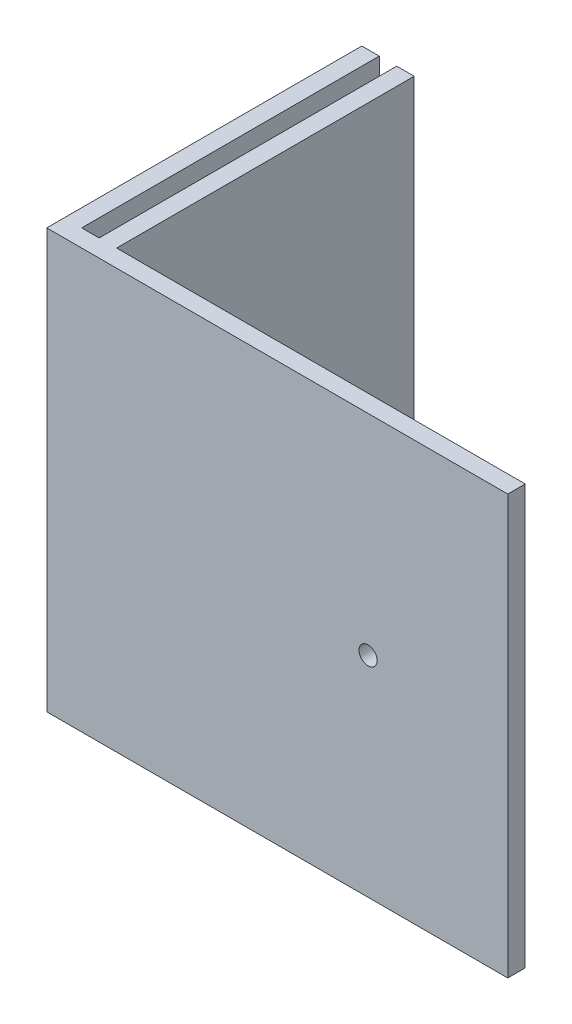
ISO-10303-21;
HEADER;
FILE_DESCRIPTION(('STEP AP214'),'2;1');
FILE_NAME('part.step','',(''),(''),'','','');
FILE_SCHEMA(('AUTOMOTIVE_DESIGN { 1 0 10303 214 1 1 1 1 }'));
ENDSEC;
DATA;
#1=APPLICATION_CONTEXT('core data for automotive mechanical design processes');
#2=APPLICATION_PROTOCOL_DEFINITION('international standard','automotive_design',2000,#1);
#3=PRODUCT_CONTEXT('',#1,'mechanical');
#4=PRODUCT('Part','Part','',(#3));
#5=PRODUCT_RELATED_PRODUCT_CATEGORY('part','',(#4));
#6=PRODUCT_DEFINITION_FORMATION('','',#4);
#7=PRODUCT_DEFINITION_CONTEXT('part definition',#1,'design');
#8=PRODUCT_DEFINITION('design','',#6,#7);
#9=PRODUCT_DEFINITION_SHAPE('','',#8);
#10=(LENGTH_UNIT() NAMED_UNIT(*) SI_UNIT(.MILLI.,.METRE.));
#11=(NAMED_UNIT(*) PLANE_ANGLE_UNIT() SI_UNIT($,.RADIAN.));
#12=(NAMED_UNIT(*) SI_UNIT($,.STERADIAN.) SOLID_ANGLE_UNIT());
#13=UNCERTAINTY_MEASURE_WITH_UNIT(LENGTH_MEASURE(1.E-05),#10,'distance_accuracy_value','');
#14=(GEOMETRIC_REPRESENTATION_CONTEXT(3) GLOBAL_UNCERTAINTY_ASSIGNED_CONTEXT((#13)) GLOBAL_UNIT_ASSIGNED_CONTEXT((#10,
#11,#12)) REPRESENTATION_CONTEXT('',''));
#15=CARTESIAN_POINT('',(0.,0.,0.));
#16=DIRECTION('',(0.,0.,1.));
#17=DIRECTION('',(1.,0.,0.));
#18=AXIS2_PLACEMENT_3D('',#15,#16,#17);
#19=CARTESIAN_POINT('',(0.,0.,0.));
#20=DIRECTION('',(0.,0.,1.));
#21=DIRECTION('',(1.,0.,0.));
#22=AXIS2_PLACEMENT_3D('',#19,#20,#21);
#23=PLANE('',#22);
#24=DIRECTION('',(-1.,0.,0.));
#25=VECTOR('',#24,1.);
#26=CARTESIAN_POINT('',(0.,76.2,0.));
#27=LINE('',#26,#25);
#28=CARTESIAN_POINT('',(-77.47,76.2,0.));
#29=VERTEX_POINT('',#28);
#30=CARTESIAN_POINT('',(-80.645,76.2,0.));
#31=VERTEX_POINT('',#30);
#32=EDGE_CURVE('E182',#29,#31,#27,.T.);
#33=ORIENTED_EDGE('',*,*,#32,.F.);
#34=DIRECTION('',(0.,-1.,0.));
#35=VECTOR('',#34,1.);
#36=CARTESIAN_POINT('',(-77.47,0.,0.));
#37=LINE('',#36,#35);
#38=CARTESIAN_POINT('',(-77.47,0.,0.));
#39=VERTEX_POINT('',#38);
#40=EDGE_CURVE('E142',#29,#39,#37,.T.);
#41=ORIENTED_EDGE('',*,*,#40,.T.);
#42=DIRECTION('',(1.,0.,0.));
#43=VECTOR('',#42,1.);
#44=CARTESIAN_POINT('',(-83.82,0.,0.));
#45=LINE('',#44,#43);
#46=CARTESIAN_POINT('',(-80.645,0.,0.));
#47=VERTEX_POINT('',#46);
#48=EDGE_CURVE('E112',#47,#39,#45,.T.);
#49=ORIENTED_EDGE('',*,*,#48,.F.);
#50=DIRECTION('',(0.,1.,0.));
#51=VECTOR('',#50,1.);
#52=CARTESIAN_POINT('',(-80.645,0.,0.));
#53=LINE('',#52,#51);
#54=EDGE_CURVE('E158',#47,#31,#53,.T.);
#55=ORIENTED_EDGE('',*,*,#54,.T.);
#56=EDGE_LOOP('',(#33,#41,#49,#55));
#57=FACE_BOUND('',#56,.T.);
#58=ADVANCED_FACE('F33',(#57),#23,.F.);
#59=CARTESIAN_POINT('',(0.,0.,3.175));
#60=DIRECTION('',(0.,0.,1.));
#61=DIRECTION('',(1.,0.,0.));
#62=AXIS2_PLACEMENT_3D('',#59,#60,#61);
#63=PLANE('',#62);
#64=DIRECTION('',(-1.,0.,0.));
#65=VECTOR('',#64,1.);
#66=CARTESIAN_POINT('',(0.,76.2,3.175));
#67=LINE('',#66,#65);
#68=CARTESIAN_POINT('',(0.,76.2,3.175));
#69=VERTEX_POINT('',#68);
#70=CARTESIAN_POINT('',(-83.82,76.2,3.175));
#71=VERTEX_POINT('',#70);
#72=EDGE_CURVE('E174',#69,#71,#67,.T.);
#73=ORIENTED_EDGE('',*,*,#72,.T.);
#74=DIRECTION('',(0.,-1.,0.));
#75=VECTOR('',#74,1.);
#76=CARTESIAN_POINT('',(-83.82,76.2,3.175));
#77=LINE('',#76,#75);
#78=CARTESIAN_POINT('',(-83.82,0.,3.175));
#79=VERTEX_POINT('',#78);
#80=EDGE_CURVE('E176',#71,#79,#77,.T.);
#81=ORIENTED_EDGE('',*,*,#80,.T.);
#82=DIRECTION('',(1.,0.,0.));
#83=VECTOR('',#82,1.);
#84=CARTESIAN_POINT('',(-83.82,0.,3.175));
#85=LINE('',#84,#83);
#86=CARTESIAN_POINT('',(0.,0.,3.175));
#87=VERTEX_POINT('',#86);
#88=EDGE_CURVE('E169',#79,#87,#85,.T.);
#89=ORIENTED_EDGE('',*,*,#88,.T.);
#90=DIRECTION('',(0.,1.,0.));
#91=VECTOR('',#90,1.);
#92=CARTESIAN_POINT('',(0.,0.,3.175));
#93=LINE('',#92,#91);
#94=EDGE_CURVE('E171',#87,#69,#93,.T.);
#95=ORIENTED_EDGE('',*,*,#94,.T.);
#96=EDGE_LOOP('',(#73,#81,#89,#95));
#97=FACE_BOUND('',#96,.T.);
#98=CARTESIAN_POINT('',(-25.4,38.1,3.175));
#99=DIRECTION('',(0.,0.,1.));
#100=DIRECTION('',(1.,0.,0.));
#101=AXIS2_PLACEMENT_3D('',#98,#99,#100);
#102=CIRCLE('',#101,1.651);
#103=CARTESIAN_POINT('',(-23.749,38.1,3.175));
#104=VERTEX_POINT('',#103);
#105=EDGE_CURVE('E163',#104,#104,#102,.T.);
#106=ORIENTED_EDGE('',*,*,#105,.F.);
#107=EDGE_LOOP('',(#106));
#108=FACE_BOUND('',#107,.T.);
#109=ADVANCED_FACE('F219',(#97,#108),#63,.T.);
#110=CARTESIAN_POINT('',(-74.295,0.,0.));
#111=VERTEX_POINT('',#110);
#112=CARTESIAN_POINT('',(0.,0.,0.));
#113=VERTEX_POINT('',#112);
#114=EDGE_CURVE('E166',#111,#113,#45,.T.);
#115=ORIENTED_EDGE('',*,*,#114,.F.);
#116=DIRECTION('',(0.,1.,0.));
#117=VECTOR('',#116,1.);
#118=CARTESIAN_POINT('',(-74.295,0.,0.));
#119=LINE('',#118,#117);
#120=CARTESIAN_POINT('',(-74.295,76.2,0.));
#121=VERTEX_POINT('',#120);
#122=EDGE_CURVE('E136',#111,#121,#119,.T.);
#123=ORIENTED_EDGE('',*,*,#122,.T.);
#124=CARTESIAN_POINT('',(0.,76.2,0.));
#125=VERTEX_POINT('',#124);
#126=EDGE_CURVE('E172',#125,#121,#27,.T.);
#127=ORIENTED_EDGE('',*,*,#126,.F.);
#128=DIRECTION('',(0.,1.,0.));
#129=VECTOR('',#128,1.);
#130=CARTESIAN_POINT('',(0.,0.,0.));
#131=LINE('',#130,#129);
#132=EDGE_CURVE('E180',#113,#125,#131,.T.);
#133=ORIENTED_EDGE('',*,*,#132,.F.);
#134=EDGE_LOOP('',(#115,#123,#127,#133));
#135=FACE_BOUND('',#134,.T.);
#136=CARTESIAN_POINT('',(-25.4,38.1,0.));
#137=DIRECTION('',(0.,0.,1.));
#138=DIRECTION('',(1.,0.,0.));
#139=AXIS2_PLACEMENT_3D('',#136,#137,#138);
#140=CIRCLE('',#139,1.651);
#141=CARTESIAN_POINT('',(-23.749,38.1,0.));
#142=VERTEX_POINT('',#141);
#143=EDGE_CURVE('E162',#142,#142,#140,.T.);
#144=ORIENTED_EDGE('',*,*,#143,.T.);
#145=EDGE_LOOP('',(#144));
#146=FACE_BOUND('',#145,.T.);
#147=ADVANCED_FACE('F199',(#135,#146),#23,.F.);
#148=CARTESIAN_POINT('',(-83.82,0.,3.175));
#149=DIRECTION('',(0.,1.,0.));
#150=DIRECTION('',(0.,0.,1.));
#151=AXIS2_PLACEMENT_3D('',#148,#149,#150);
#152=PLANE('',#151);
#153=DIRECTION('',(0.,0.,-1.));
#154=VECTOR('',#153,1.);
#155=CARTESIAN_POINT('',(0.,0.,3.175));
#156=LINE('',#155,#154);
#157=EDGE_CURVE('E11',#87,#113,#156,.T.);
#158=ORIENTED_EDGE('',*,*,#157,.F.);
#159=ORIENTED_EDGE('',*,*,#88,.F.);
#160=DIRECTION('',(0.,0.,-1.));
#161=VECTOR('',#160,1.);
#162=CARTESIAN_POINT('',(-83.82,0.,3.175));
#163=LINE('',#162,#161);
#164=CARTESIAN_POINT('',(-83.82,0.,-54.102));
#165=VERTEX_POINT('',#164);
#166=EDGE_CURVE('E178',#79,#165,#163,.T.);
#167=ORIENTED_EDGE('',*,*,#166,.T.);
#168=DIRECTION('',(1.,0.,0.));
#169=VECTOR('',#168,1.);
#170=CARTESIAN_POINT('',(-83.82,0.,-54.102));
#171=LINE('',#170,#169);
#172=CARTESIAN_POINT('',(-80.645,0.,-54.102));
#173=VERTEX_POINT('',#172);
#174=EDGE_CURVE('E147',#165,#173,#171,.T.);
#175=ORIENTED_EDGE('',*,*,#174,.T.);
#176=DIRECTION('',(0.,0.,1.));
#177=VECTOR('',#176,1.);
#178=CARTESIAN_POINT('',(-80.645,0.,-54.102));
#179=LINE('',#178,#177);
#180=EDGE_CURVE('E55',#173,#47,#179,.T.);
#181=ORIENTED_EDGE('',*,*,#180,.T.);
#182=ORIENTED_EDGE('',*,*,#48,.T.);
#183=DIRECTION('',(0.,0.,1.));
#184=VECTOR('',#183,1.);
#185=CARTESIAN_POINT('',(-77.47,0.,-54.102));
#186=LINE('',#185,#184);
#187=CARTESIAN_POINT('',(-77.47,0.,-54.102));
#188=VERTEX_POINT('',#187);
#189=EDGE_CURVE('E107',#188,#39,#186,.T.);
#190=ORIENTED_EDGE('',*,*,#189,.F.);
#191=DIRECTION('',(1.,0.,0.));
#192=VECTOR('',#191,1.);
#193=CARTESIAN_POINT('',(-77.47,0.,-54.102));
#194=LINE('',#193,#192);
#195=CARTESIAN_POINT('',(-74.295,0.,-54.102));
#196=VERTEX_POINT('',#195);
#197=EDGE_CURVE('E110',#188,#196,#194,.T.);
#198=ORIENTED_EDGE('',*,*,#197,.T.);
#199=DIRECTION('',(0.,0.,1.));
#200=VECTOR('',#199,1.);
#201=CARTESIAN_POINT('',(-74.295,0.,-54.102));
#202=LINE('',#201,#200);
#203=EDGE_CURVE('E48',#196,#111,#202,.T.);
#204=ORIENTED_EDGE('',*,*,#203,.T.);
#205=ORIENTED_EDGE('',*,*,#114,.T.);
#206=EDGE_LOOP('',(#158,#159,#167,#175,#181,#182,#190,#198,#204,#205));
#207=FACE_BOUND('',#206,.T.);
#208=ADVANCED_FACE('F35',(#207),#152,.F.);
#209=CARTESIAN_POINT('',(0.,0.,3.175));
#210=DIRECTION('',(-1.,0.,0.));
#211=DIRECTION('',(0.,0.,1.));
#212=AXIS2_PLACEMENT_3D('',#209,#210,#211);
#213=PLANE('',#212);
#214=ORIENTED_EDGE('',*,*,#132,.T.);
#215=DIRECTION('',(0.,0.,-1.));
#216=VECTOR('',#215,1.);
#217=CARTESIAN_POINT('',(0.,76.2,3.175));
#218=LINE('',#217,#216);
#219=EDGE_CURVE('E41',#69,#125,#218,.T.);
#220=ORIENTED_EDGE('',*,*,#219,.F.);
#221=ORIENTED_EDGE('',*,*,#94,.F.);
#222=ORIENTED_EDGE('',*,*,#157,.T.);
#223=EDGE_LOOP('',(#214,#220,#221,#222));
#224=FACE_BOUND('',#223,.T.);
#225=ADVANCED_FACE('F221',(#224),#213,.F.);
#226=CARTESIAN_POINT('',(0.,76.2,3.175));
#227=DIRECTION('',(0.,-1.,0.));
#228=DIRECTION('',(1.,0.,0.));
#229=AXIS2_PLACEMENT_3D('',#226,#227,#228);
#230=PLANE('',#229);
#231=ORIENTED_EDGE('',*,*,#126,.T.);
#232=DIRECTION('',(0.,0.,1.));
#233=VECTOR('',#232,1.);
#234=CARTESIAN_POINT('',(-74.295,76.2,-54.102));
#235=LINE('',#234,#233);
#236=CARTESIAN_POINT('',(-74.295,76.2,-54.102));
#237=VERTEX_POINT('',#236);
#238=EDGE_CURVE('E137',#237,#121,#235,.T.);
#239=ORIENTED_EDGE('',*,*,#238,.F.);
#240=DIRECTION('',(-1.,0.,0.));
#241=VECTOR('',#240,1.);
#242=CARTESIAN_POINT('',(-77.47,76.2,-54.102));
#243=LINE('',#242,#241);
#244=CARTESIAN_POINT('',(-77.47,76.2,-54.102));
#245=VERTEX_POINT('',#244);
#246=EDGE_CURVE('E116',#237,#245,#243,.T.);
#247=ORIENTED_EDGE('',*,*,#246,.T.);
#248=DIRECTION('',(0.,0.,1.));
#249=VECTOR('',#248,1.);
#250=CARTESIAN_POINT('',(-77.47,76.2,-54.102));
#251=LINE('',#250,#249);
#252=EDGE_CURVE('E130',#245,#29,#251,.T.);
#253=ORIENTED_EDGE('',*,*,#252,.T.);
#254=ORIENTED_EDGE('',*,*,#32,.T.);
#255=DIRECTION('',(0.,0.,1.));
#256=VECTOR('',#255,1.);
#257=CARTESIAN_POINT('',(-80.645,76.2,-54.102));
#258=LINE('',#257,#256);
#259=CARTESIAN_POINT('',(-80.645,76.2,-54.102));
#260=VERTEX_POINT('',#259);
#261=EDGE_CURVE('E155',#260,#31,#258,.T.);
#262=ORIENTED_EDGE('',*,*,#261,.F.);
#263=DIRECTION('',(-1.,0.,0.));
#264=VECTOR('',#263,1.);
#265=CARTESIAN_POINT('',(-83.82,76.2,-54.102));
#266=LINE('',#265,#264);
#267=CARTESIAN_POINT('',(-83.82,76.2,-54.102));
#268=VERTEX_POINT('',#267);
#269=EDGE_CURVE('E152',#260,#268,#266,.T.);
#270=ORIENTED_EDGE('',*,*,#269,.T.);
#271=DIRECTION('',(0.,0.,-1.));
#272=VECTOR('',#271,1.);
#273=CARTESIAN_POINT('',(-83.82,76.2,3.175));
#274=LINE('',#273,#272);
#275=EDGE_CURVE('E186',#71,#268,#274,.T.);
#276=ORIENTED_EDGE('',*,*,#275,.F.);
#277=ORIENTED_EDGE('',*,*,#72,.F.);
#278=ORIENTED_EDGE('',*,*,#219,.T.);
#279=EDGE_LOOP('',(#231,#239,#247,#253,#254,#262,#270,#276,#277,#278));
#280=FACE_BOUND('',#279,.T.);
#281=ADVANCED_FACE('F192',(#280),#230,.F.);
#282=CARTESIAN_POINT('',(-83.82,76.2,3.175));
#283=DIRECTION('',(1.,0.,0.));
#284=DIRECTION('',(0.,1.,0.));
#285=AXIS2_PLACEMENT_3D('',#282,#283,#284);
#286=PLANE('',#285);
#287=ORIENTED_EDGE('',*,*,#275,.T.);
#288=DIRECTION('',(0.,-1.,0.));
#289=VECTOR('',#288,1.);
#290=CARTESIAN_POINT('',(-83.82,76.2,-54.102));
#291=LINE('',#290,#289);
#292=EDGE_CURVE('E144',#268,#165,#291,.T.);
#293=ORIENTED_EDGE('',*,*,#292,.T.);
#294=ORIENTED_EDGE('',*,*,#166,.F.);
#295=ORIENTED_EDGE('',*,*,#80,.F.);
#296=EDGE_LOOP('',(#287,#293,#294,#295));
#297=FACE_BOUND('',#296,.T.);
#298=ADVANCED_FACE('F216',(#297),#286,.F.);
#299=CARTESIAN_POINT('',(-25.4,38.1,3.175));
#300=DIRECTION('',(0.,0.,-1.));
#301=DIRECTION('',(-1.,0.,0.));
#302=AXIS2_PLACEMENT_3D('',#299,#300,#301);
#303=CYLINDRICAL_SURFACE('',#302,1.651);
#304=ORIENTED_EDGE('',*,*,#105,.T.);
#305=EDGE_LOOP('',(#304));
#306=FACE_BOUND('',#305,.T.);
#307=ORIENTED_EDGE('',*,*,#143,.F.);
#308=EDGE_LOOP('',(#307));
#309=FACE_BOUND('',#308,.T.);
#310=ADVANCED_FACE('F264',(#306,#309),#303,.F.);
#311=CARTESIAN_POINT('',(-80.645,76.2,-54.102));
#312=DIRECTION('',(1.,0.,0.));
#313=DIRECTION('',(0.,0.,-1.));
#314=AXIS2_PLACEMENT_3D('',#311,#312,#313);
#315=PLANE('',#314);
#316=ORIENTED_EDGE('',*,*,#54,.F.);
#317=ORIENTED_EDGE('',*,*,#180,.F.);
#318=DIRECTION('',(0.,1.,0.));
#319=VECTOR('',#318,1.);
#320=CARTESIAN_POINT('',(-80.645,76.2,-54.102));
#321=LINE('',#320,#319);
#322=EDGE_CURVE('E149',#173,#260,#321,.T.);
#323=ORIENTED_EDGE('',*,*,#322,.T.);
#324=ORIENTED_EDGE('',*,*,#261,.T.);
#325=EDGE_LOOP('',(#316,#317,#323,#324));
#326=FACE_BOUND('',#325,.T.);
#327=ADVANCED_FACE('F206',(#326),#315,.T.);
#328=CARTESIAN_POINT('',(-83.82,0.,-54.102));
#329=DIRECTION('',(0.,0.,1.));
#330=DIRECTION('',(1.,0.,0.));
#331=AXIS2_PLACEMENT_3D('',#328,#329,#330);
#332=PLANE('',#331);
#333=ORIENTED_EDGE('',*,*,#292,.F.);
#334=ORIENTED_EDGE('',*,*,#269,.F.);
#335=ORIENTED_EDGE('',*,*,#322,.F.);
#336=ORIENTED_EDGE('',*,*,#174,.F.);
#337=EDGE_LOOP('',(#333,#334,#335,#336));
#338=FACE_BOUND('',#337,.T.);
#339=ADVANCED_FACE('F212',(#338),#332,.F.);
#340=CARTESIAN_POINT('',(-77.47,0.,-54.102));
#341=DIRECTION('',(-1.,0.,0.));
#342=DIRECTION('',(0.,0.,1.));
#343=AXIS2_PLACEMENT_3D('',#340,#341,#342);
#344=PLANE('',#343);
#345=ORIENTED_EDGE('',*,*,#40,.F.);
#346=ORIENTED_EDGE('',*,*,#252,.F.);
#347=DIRECTION('',(0.,-1.,0.));
#348=VECTOR('',#347,1.);
#349=CARTESIAN_POINT('',(-77.47,0.,-54.102));
#350=LINE('',#349,#348);
#351=EDGE_CURVE('E123',#245,#188,#350,.T.);
#352=ORIENTED_EDGE('',*,*,#351,.T.);
#353=ORIENTED_EDGE('',*,*,#189,.T.);
#354=EDGE_LOOP('',(#345,#346,#352,#353));
#355=FACE_BOUND('',#354,.T.);
#356=ADVANCED_FACE('F128',(#355),#344,.T.);
#357=CARTESIAN_POINT('',(-74.295,0.,-54.102));
#358=DIRECTION('',(1.,0.,0.));
#359=DIRECTION('',(0.,0.,-1.));
#360=AXIS2_PLACEMENT_3D('',#357,#358,#359);
#361=PLANE('',#360);
#362=ORIENTED_EDGE('',*,*,#122,.F.);
#363=ORIENTED_EDGE('',*,*,#203,.F.);
#364=DIRECTION('',(0.,1.,0.));
#365=VECTOR('',#364,1.);
#366=CARTESIAN_POINT('',(-74.295,0.,-54.102));
#367=LINE('',#366,#365);
#368=EDGE_CURVE('E126',#196,#237,#367,.T.);
#369=ORIENTED_EDGE('',*,*,#368,.T.);
#370=ORIENTED_EDGE('',*,*,#238,.T.);
#371=EDGE_LOOP('',(#362,#363,#369,#370));
#372=FACE_BOUND('',#371,.T.);
#373=ADVANCED_FACE('F202',(#372),#361,.T.);
#374=CARTESIAN_POINT('',(-77.47,76.2,-54.102));
#375=DIRECTION('',(0.,0.,-1.));
#376=DIRECTION('',(-1.,0.,0.));
#377=AXIS2_PLACEMENT_3D('',#374,#375,#376);
#378=PLANE('',#377);
#379=ORIENTED_EDGE('',*,*,#351,.F.);
#380=ORIENTED_EDGE('',*,*,#246,.F.);
#381=ORIENTED_EDGE('',*,*,#368,.F.);
#382=ORIENTED_EDGE('',*,*,#197,.F.);
#383=EDGE_LOOP('',(#379,#380,#381,#382));
#384=FACE_BOUND('',#383,.T.);
#385=ADVANCED_FACE('F121',(#384),#378,.T.);
#386=CLOSED_SHELL('',(#58,#109,#147,#208,#225,#281,#298,#310,#327,#339,#356,#373,#385));
#387=MANIFOLD_SOLID_BREP('B2',#386);
#388=ADVANCED_BREP_SHAPE_REPRESENTATION('',(#18,#387),#14);
#389=SHAPE_DEFINITION_REPRESENTATION(#9,#388);
ENDSEC;
END-ISO-10303-21;
